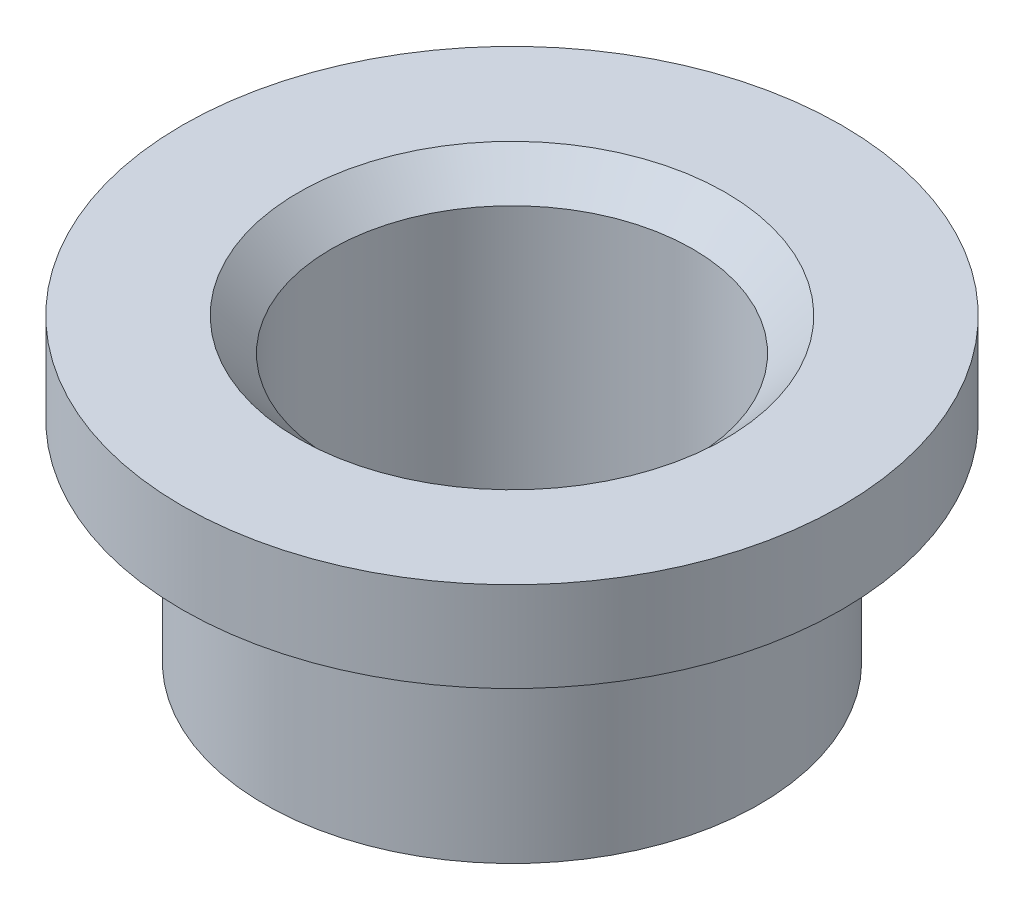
ISO-10303-21;
HEADER;
FILE_DESCRIPTION(('STEP AP214'),'2;1');
FILE_NAME('part.step','',(''),(''),'','','');
FILE_SCHEMA(('AUTOMOTIVE_DESIGN { 1 0 10303 214 1 1 1 1 }'));
ENDSEC;
DATA;
#1=APPLICATION_CONTEXT('core data for automotive mechanical design processes');
#2=APPLICATION_PROTOCOL_DEFINITION('international standard','automotive_design',2000,#1);
#3=PRODUCT_CONTEXT('',#1,'mechanical');
#4=PRODUCT('Part','Part','',(#3));
#5=PRODUCT_RELATED_PRODUCT_CATEGORY('part','',(#4));
#6=PRODUCT_DEFINITION_FORMATION('','',#4);
#7=PRODUCT_DEFINITION_CONTEXT('part definition',#1,'design');
#8=PRODUCT_DEFINITION('design','',#6,#7);
#9=PRODUCT_DEFINITION_SHAPE('','',#8);
#10=(LENGTH_UNIT() NAMED_UNIT(*) SI_UNIT(.MILLI.,.METRE.));
#11=(NAMED_UNIT(*) PLANE_ANGLE_UNIT() SI_UNIT($,.RADIAN.));
#12=(NAMED_UNIT(*) SI_UNIT($,.STERADIAN.) SOLID_ANGLE_UNIT());
#13=UNCERTAINTY_MEASURE_WITH_UNIT(LENGTH_MEASURE(1.E-05),#10,'distance_accuracy_value','');
#14=(GEOMETRIC_REPRESENTATION_CONTEXT(3) GLOBAL_UNCERTAINTY_ASSIGNED_CONTEXT((#13)) GLOBAL_UNIT_ASSIGNED_CONTEXT((#10,
#11,#12)) REPRESENTATION_CONTEXT('',''));
#15=CARTESIAN_POINT('',(0.,0.,0.));
#16=DIRECTION('',(0.,0.,1.));
#17=DIRECTION('',(1.,0.,0.));
#18=AXIS2_PLACEMENT_3D('',#15,#16,#17);
#19=CARTESIAN_POINT('',(0.,3.81,0.));
#20=DIRECTION('',(0.,-1.,0.));
#21=DIRECTION('',(0.,0.,-1.));
#22=AXIS2_PLACEMENT_3D('',#19,#20,#21);
#23=CYLINDRICAL_SURFACE('',#22,13.97);
#24=CARTESIAN_POINT('',(0.,3.81,0.));
#25=DIRECTION('',(0.,1.,0.));
#26=DIRECTION('',(0.,0.,1.));
#27=AXIS2_PLACEMENT_3D('',#24,#25,#26);
#28=CIRCLE('',#27,13.97);
#29=CARTESIAN_POINT('',(0.,3.81,-13.97));
#30=VERTEX_POINT('',#29);
#31=EDGE_CURVE('E41',#30,#30,#28,.T.);
#32=CARTESIAN_POINT('',(0.,0.,0.));
#33=DIRECTION('',(0.,1.,0.));
#34=DIRECTION('',(0.,0.,1.));
#35=AXIS2_PLACEMENT_3D('',#32,#33,#34);
#36=CIRCLE('',#35,13.97);
#37=CARTESIAN_POINT('',(0.,0.,-13.97));
#38=VERTEX_POINT('',#37);
#39=EDGE_CURVE('E37',#38,#38,#36,.T.);
#40=CARTESIAN_POINT('',(0.,3.81,-13.97));
#41=CARTESIAN_POINT('',(0.,3.7703125,-13.97));
#42=CARTESIAN_POINT('',(0.,3.730625,-13.97));
#43=CARTESIAN_POINT('',(0.,3.65125,-13.97));
#44=CARTESIAN_POINT('',(0.,3.6115625,-13.97));
#45=CARTESIAN_POINT('',(0.,3.5321875,-13.97));
#46=CARTESIAN_POINT('',(0.,3.4925,-13.97));
#47=CARTESIAN_POINT('',(0.,3.413125,-13.97));
#48=CARTESIAN_POINT('',(0.,3.3734375,-13.97));
#49=CARTESIAN_POINT('',(0.,3.2940625,-13.97));
#50=CARTESIAN_POINT('',(0.,3.254375,-13.97));
#51=CARTESIAN_POINT('',(0.,3.175,-13.97));
#52=CARTESIAN_POINT('',(0.,3.1353125,-13.97));
#53=CARTESIAN_POINT('',(0.,3.0559375,-13.97));
#54=CARTESIAN_POINT('',(0.,3.01625,-13.97));
#55=CARTESIAN_POINT('',(0.,2.936875,-13.97));
#56=CARTESIAN_POINT('',(0.,2.8971875,-13.97));
#57=CARTESIAN_POINT('',(0.,2.8178125,-13.97));
#58=CARTESIAN_POINT('',(0.,2.778125,-13.97));
#59=CARTESIAN_POINT('',(0.,2.69875,-13.97));
#60=CARTESIAN_POINT('',(0.,2.6590625,-13.97));
#61=CARTESIAN_POINT('',(0.,2.5796875,-13.97));
#62=CARTESIAN_POINT('',(0.,2.54,-13.97));
#63=CARTESIAN_POINT('',(0.,2.460625,-13.97));
#64=CARTESIAN_POINT('',(0.,2.4209375,-13.97));
#65=CARTESIAN_POINT('',(0.,2.3415625,-13.97));
#66=CARTESIAN_POINT('',(0.,2.301875,-13.97));
#67=CARTESIAN_POINT('',(0.,2.2225,-13.97));
#68=CARTESIAN_POINT('',(0.,2.1828125,-13.97));
#69=CARTESIAN_POINT('',(0.,2.1034375,-13.97));
#70=CARTESIAN_POINT('',(0.,2.06375,-13.97));
#71=CARTESIAN_POINT('',(0.,1.984375,-13.97));
#72=CARTESIAN_POINT('',(0.,1.9446875,-13.97));
#73=CARTESIAN_POINT('',(0.,1.8653125,-13.97));
#74=CARTESIAN_POINT('',(0.,1.825625,-13.97));
#75=CARTESIAN_POINT('',(0.,1.74625,-13.97));
#76=CARTESIAN_POINT('',(0.,1.7065625,-13.97));
#77=CARTESIAN_POINT('',(0.,1.6271875,-13.97));
#78=CARTESIAN_POINT('',(0.,1.5875,-13.97));
#79=CARTESIAN_POINT('',(0.,1.508125,-13.97));
#80=CARTESIAN_POINT('',(0.,1.4684375,-13.97));
#81=CARTESIAN_POINT('',(0.,1.3890625,-13.97));
#82=CARTESIAN_POINT('',(0.,1.349375,-13.97));
#83=CARTESIAN_POINT('',(0.,1.27,-13.97));
#84=CARTESIAN_POINT('',(0.,1.2303125,-13.97));
#85=CARTESIAN_POINT('',(0.,1.1509375,-13.97));
#86=CARTESIAN_POINT('',(0.,1.11125,-13.97));
#87=CARTESIAN_POINT('',(0.,1.031875,-13.97));
#88=CARTESIAN_POINT('',(0.,0.9921875,-13.97));
#89=CARTESIAN_POINT('',(0.,0.9128125,-13.97));
#90=CARTESIAN_POINT('',(0.,0.873125,-13.97));
#91=CARTESIAN_POINT('',(0.,0.79375,-13.97));
#92=CARTESIAN_POINT('',(0.,0.7540625,-13.97));
#93=CARTESIAN_POINT('',(0.,0.6746875,-13.97));
#94=CARTESIAN_POINT('',(0.,0.635,-13.97));
#95=CARTESIAN_POINT('',(0.,0.555625,-13.97));
#96=CARTESIAN_POINT('',(0.,0.5159375,-13.97));
#97=CARTESIAN_POINT('',(0.,0.4365625,-13.97));
#98=CARTESIAN_POINT('',(0.,0.396875,-13.97));
#99=CARTESIAN_POINT('',(0.,0.3175,-13.97));
#100=CARTESIAN_POINT('',(0.,0.2778125,-13.97));
#101=CARTESIAN_POINT('',(0.,0.1984375,-13.97));
#102=CARTESIAN_POINT('',(0.,0.15875,-13.97));
#103=CARTESIAN_POINT('',(0.,0.0793749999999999,-13.97));
#104=CARTESIAN_POINT('',(0.,0.0396874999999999,-13.97));
#105=CARTESIAN_POINT('',(0.,0.,-13.97));
#106=B_SPLINE_CURVE_WITH_KNOTS('',3,(#40,#41,#42,#43,#44,#45,#46,#47,#48,#49,#50,#51,#52,#53,
#54,#55,#56,#57,#58,#59,#60,#61,#62,#63,#64,#65,#66,#67,#68,#69,#70,#71,#72,#73,#74,#75,#76,#77,
#78,#79,#80,#81,#82,#83,#84,#85,#86,#87,#88,#89,#90,#91,#92,#93,#94,#95,#96,#97,#98,#99,#100,
#101,#102,#103,#104,#105),.UNSPECIFIED.,.F.,.F.,(4,2,2,2,2,2,2,2,2,2,2,2,2,2,2,2,2,2,2,2,2,2,2,
2,2,2,2,2,2,2,2,2,4),(0.,0.1190625,0.238125,0.3571875,0.47625,0.595312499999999,0.714375,
0.833437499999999,0.952499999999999,1.0715625,1.190625,1.3096875,1.42875,1.5478125,1.666875,
1.7859375,1.905,2.0240625,2.143125,2.2621875,2.38125,2.5003125,2.619375,2.7384375,2.8575,
2.9765625,3.095625,3.2146875,3.33375,3.4528125,3.571875,3.6909375,3.81),.UNSPECIFIED.);
#107=EDGE_CURVE('BSEAM34',#30,#38,#106,.T.);
#108=ORIENTED_EDGE('',*,*,#31,.F.);
#109=ORIENTED_EDGE('',*,*,#39,.T.);
#110=ORIENTED_EDGE('',*,*,#107,.T.);
#111=ORIENTED_EDGE('',*,*,#107,.F.);
#112=EDGE_LOOP('',(#108,#110,#109,#111));
#113=FACE_BOUND('',#112,.T.);
#114=ADVANCED_FACE('F34',(#113),#23,.T.);
#115=CARTESIAN_POINT('',(0.,3.81,0.));
#116=DIRECTION('',(0.,1.,0.));
#117=DIRECTION('',(0.,0.,1.));
#118=AXIS2_PLACEMENT_3D('',#115,#116,#117);
#119=PLANE('',#118);
#120=CARTESIAN_POINT('',(0.,3.81,0.));
#121=DIRECTION('',(0.,1.,0.));
#122=DIRECTION('',(0.,0.,1.));
#123=AXIS2_PLACEMENT_3D('',#120,#121,#122);
#124=CIRCLE('',#123,9.0424);
#125=CARTESIAN_POINT('',(0.,3.81,9.0424));
#126=VERTEX_POINT('',#125);
#127=EDGE_CURVE('E56',#126,#126,#124,.T.);
#128=ORIENTED_EDGE('',*,*,#127,.F.);
#129=EDGE_LOOP('',(#128));
#130=FACE_BOUND('',#129,.T.);
#131=ORIENTED_EDGE('',*,*,#31,.T.);
#132=EDGE_LOOP('',(#131));
#133=FACE_BOUND('',#132,.T.);
#134=ADVANCED_FACE('F62',(#130,#133),#119,.T.);
#135=CARTESIAN_POINT('',(0.,0.,0.));
#136=DIRECTION('',(0.,1.,0.));
#137=DIRECTION('',(0.,0.,1.));
#138=AXIS2_PLACEMENT_3D('',#135,#136,#137);
#139=PLANE('',#138);
#140=CARTESIAN_POINT('',(0.,0.,0.));
#141=DIRECTION('',(0.,-1.,0.));
#142=DIRECTION('',(0.,0.,-1.));
#143=AXIS2_PLACEMENT_3D('',#140,#141,#142);
#144=CIRCLE('',#143,10.4775);
#145=CARTESIAN_POINT('',(0.,0.,-10.4775));
#146=VERTEX_POINT('',#145);
#147=EDGE_CURVE('E10',#146,#146,#144,.T.);
#148=ORIENTED_EDGE('',*,*,#147,.F.);
#149=EDGE_LOOP('',(#148));
#150=FACE_BOUND('',#149,.T.);
#151=ORIENTED_EDGE('',*,*,#39,.F.);
#152=EDGE_LOOP('',(#151));
#153=FACE_BOUND('',#152,.T.);
#154=ADVANCED_FACE('F65',(#150,#153),#139,.F.);
#155=CARTESIAN_POINT('',(0.,-8.89,0.));
#156=DIRECTION('',(0.,1.,0.));
#157=DIRECTION('',(0.,0.,1.));
#158=AXIS2_PLACEMENT_3D('',#155,#156,#157);
#159=CYLINDRICAL_SURFACE('',#158,10.4775);
#160=CARTESIAN_POINT('',(0.,-8.89,0.));
#161=DIRECTION('',(0.,-1.,0.));
#162=DIRECTION('',(0.,0.,-1.));
#163=AXIS2_PLACEMENT_3D('',#160,#161,#162);
#164=CIRCLE('',#163,10.4775);
#165=CARTESIAN_POINT('',(0.,-8.89,-10.4775));
#166=VERTEX_POINT('',#165);
#167=EDGE_CURVE('E47',#166,#166,#164,.T.);
#168=ORIENTED_EDGE('',*,*,#167,.F.);
#169=EDGE_LOOP('',(#168));
#170=FACE_BOUND('',#169,.T.);
#171=ORIENTED_EDGE('',*,*,#147,.T.);
#172=EDGE_LOOP('',(#171));
#173=FACE_BOUND('',#172,.T.);
#174=ADVANCED_FACE('F75',(#170,#173),#159,.T.);
#175=CARTESIAN_POINT('',(0.,-8.89,0.));
#176=DIRECTION('',(0.,-1.,0.));
#177=DIRECTION('',(0.,0.,-1.));
#178=AXIS2_PLACEMENT_3D('',#175,#176,#177);
#179=PLANE('',#178);
#180=CARTESIAN_POINT('',(0.,-8.89,0.));
#181=DIRECTION('',(0.,1.,0.));
#182=DIRECTION('',(0.,0.,1.));
#183=AXIS2_PLACEMENT_3D('',#180,#181,#182);
#184=CIRCLE('',#183,7.6581);
#185=CARTESIAN_POINT('',(0.,-8.89,7.6581));
#186=VERTEX_POINT('',#185);
#187=EDGE_CURVE('E50',#186,#186,#184,.T.);
#188=ORIENTED_EDGE('',*,*,#187,.T.);
#189=EDGE_LOOP('',(#188));
#190=FACE_BOUND('',#189,.T.);
#191=ORIENTED_EDGE('',*,*,#167,.T.);
#192=EDGE_LOOP('',(#191));
#193=FACE_BOUND('',#192,.T.);
#194=ADVANCED_FACE('F81',(#190,#193),#179,.T.);
#195=CARTESIAN_POINT('',(0.,3.81,0.));
#196=DIRECTION('',(0.,1.,0.));
#197=DIRECTION('',(0.,0.,1.));
#198=AXIS2_PLACEMENT_3D('',#195,#196,#197);
#199=CYLINDRICAL_SURFACE('',#198,7.6581);
#200=ORIENTED_EDGE('',*,*,#187,.F.);
#201=EDGE_LOOP('',(#200));
#202=FACE_BOUND('',#201,.T.);
#203=CARTESIAN_POINT('',(0.,2.4257,0.));
#204=DIRECTION('',(0.,1.,0.));
#205=DIRECTION('',(0.,0.,1.));
#206=AXIS2_PLACEMENT_3D('',#203,#204,#205);
#207=CIRCLE('',#206,7.6581);
#208=CARTESIAN_POINT('',(0.,2.4257,7.6581));
#209=VERTEX_POINT('',#208);
#210=EDGE_CURVE('E53',#209,#209,#207,.T.);
#211=ORIENTED_EDGE('',*,*,#210,.T.);
#212=EDGE_LOOP('',(#211));
#213=FACE_BOUND('',#212,.T.);
#214=ADVANCED_FACE('F87',(#202,#213),#199,.F.);
#215=CARTESIAN_POINT('',(0.,3.81,0.));
#216=DIRECTION('',(0.,1.,0.));
#217=DIRECTION('',(0.,0.,1.));
#218=AXIS2_PLACEMENT_3D('',#215,#216,#217);
#219=CONICAL_SURFACE('',#218,9.0424,0.785398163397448);
#220=ORIENTED_EDGE('',*,*,#210,.F.);
#221=EDGE_LOOP('',(#220));
#222=FACE_BOUND('',#221,.T.);
#223=ORIENTED_EDGE('',*,*,#127,.T.);
#224=EDGE_LOOP('',(#223));
#225=FACE_BOUND('',#224,.T.);
#226=ADVANCED_FACE('F60',(#222,#225),#219,.F.);
#227=CLOSED_SHELL('',(#114,#134,#154,#174,#194,#214,#226));
#228=MANIFOLD_SOLID_BREP('B2',#227);
#229=ADVANCED_BREP_SHAPE_REPRESENTATION('',(#18,#228),#14);
#230=SHAPE_DEFINITION_REPRESENTATION(#9,#229);
ENDSEC;
END-ISO-10303-21;
